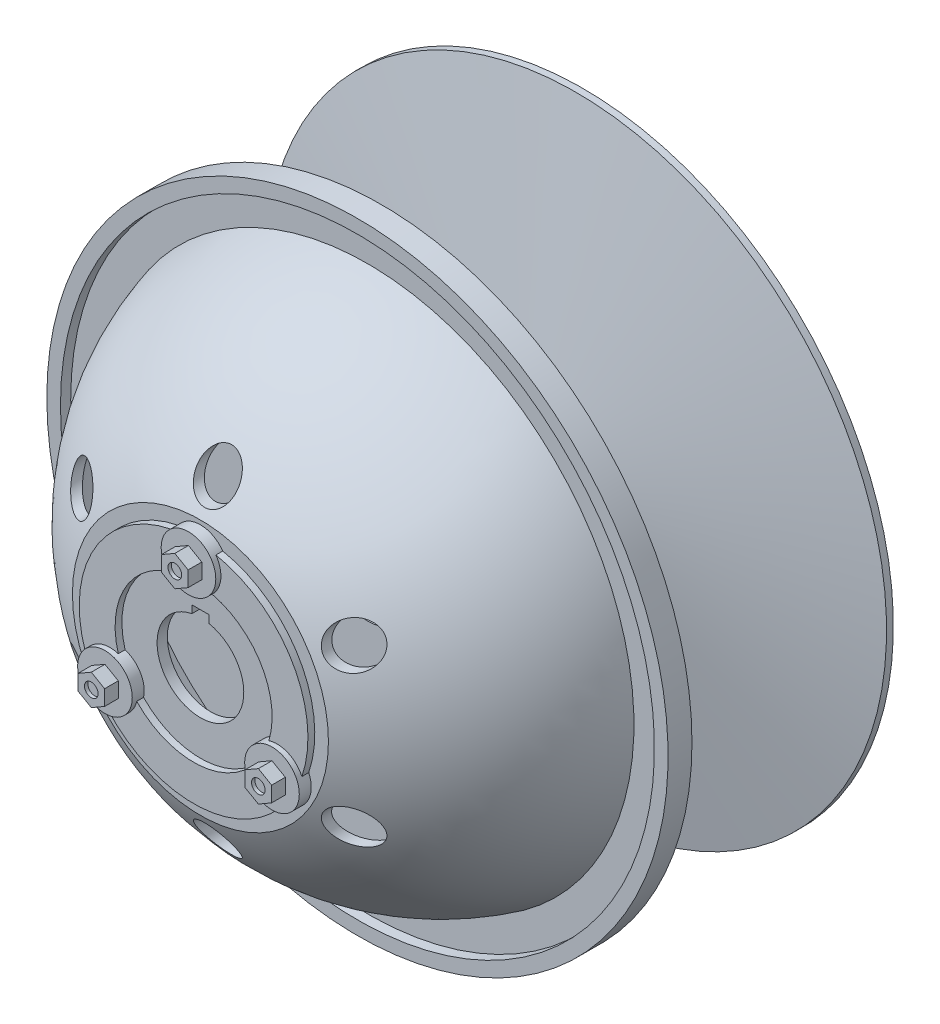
from build123d import *

# Parameters (mm, degrees)
CROQUIS2_R            = 33.5
CROQUIS2_R_2          = 23
EXTRUIR1_DEPTH        = 2
CROQUIS3_R            = 8
EXTRUIR2_DEPTH        = 3.5
EXTRUIR3_DEPTH        = 4
CROQUIS5_R            = 2
CORTAR_EXTRUIR1_DEPTH = 1
CROQUIS6_R            = 6
CORTAR_EXTRUIR2_DEPTH = 45
CORTAR_EXTRUIR3_DEPTH = 171.604806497


with BuildPart() as part:
    # Croquis1 → Revoluci_n1 (revolve)
    with BuildSketch(Plane(origin=(0, 0, 0), x_dir=(0, 0, -1), z_dir=(1, 0, 0)), mode=Mode.PRIVATE) as revoluci_n1_sk:
        with BuildLine():
            Line((0, 0), (0, 91))
            Line((0, 91), (-2, 91))
            Line((-2, 91), (-15, 17.5))
            Line((-15, 17.5), (-44, 17.5))
            Line((-44, 17.5), (-59, 91))
            Line((-59, 91), (-66, 91))
            Line((-66, 91), (-66, 87))
            Line((-66, 87), (-63, 87))
            Line((-63, 87), (-63, 78))
            ThreePointArc((-63, 78), (-91.919380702, 63.096905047), (-112, 37.5))
            Line((-112, 37.5), (-112, 0))
            Line((-112, 0), (0, 0))
        make_face()
    revolve(revoluci_n1_sk.sketch.rotate(Axis((0, 0, 0), (0, 0, 1)), 90), axis=Axis((0, 0, 0), (0, 0, 1)))

    # Croquis2 → Extruir1 (add)
    with BuildSketch(Plane.XY.offset(112)):
        Circle(CROQUIS2_R)
        Circle(CROQUIS2_R_2, mode=Mode.SUBTRACT)
    extrude(amount=EXTRUIR1_DEPTH)

    # Croquis3 → Extruir2 (add)
    with BuildSketch(Plane.XY.offset(112)):
        with Locations(Location((24.465217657, -14.125, 0), (0, 0, 192.535048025))):
            Circle(CROQUIS3_R)
        with Locations(Location((0, 28.25, 0), (0, 0, 144.85581182))):
            Circle(CROQUIS3_R)
        with Locations(Location((-24.465217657, -14.125, 0), (0, 0, 155.14418818))):
            Circle(CROQUIS3_R)
    extrude(amount=EXTRUIR2_DEPTH)

    # Croquis4 → Extruir3 (add)
    with BuildSketch(Plane.XY.offset(115.5)):
        Polygon((20.570432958, -16.373654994), (20.570432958, -11.876345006), (24.465217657, -9.627690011), (28.360002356, -11.876345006), (28.360002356, -16.373654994), (24.465217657, -18.622309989), align=None)
        Polygon((-3.894784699, 30.498654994), (0, 32.747309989), (3.894784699, 30.498654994), (3.894784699, 26.001345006), (0, 23.752690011), (-3.894784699, 26.001345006), align=None)
        Polygon((-24.465217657, -9.627690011), (-20.570432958, -11.876345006), (-20.570432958, -16.373654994), (-24.465217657, -18.622309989), (-28.360002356, -16.373654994), (-28.360002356, -11.876345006), align=None)
    extrude(amount=EXTRUIR3_DEPTH)

    # Croquis5 → Cortar-Extruir1 (cut)
    with BuildSketch(Plane.XY.offset(119.5)):
        with Locations((0, 28.25)):
            Circle(CROQUIS5_R)
        with Locations((24.465217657, -14.125)):
            Circle(CROQUIS5_R)
        with Locations((-24.465217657, -14.125)):
            Circle(CROQUIS5_R)
    extrude(amount=-CORTAR_EXTRUIR1_DEPTH, mode=Mode.SUBTRACT)

    # Croquis6 → Cortar-Extruir2 (cut)
    with BuildSketch(Plane.XY.offset(112)):
        with Locations((0, 46)):
            Circle(CROQUIS6_R)
        with Locations((39.837168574, 23)):
            Circle(CROQUIS6_R)
        with Locations((39.837168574, -23)):
            Circle(CROQUIS6_R)
        with Locations((0, -46)):
            Circle(CROQUIS6_R)
        with Locations((-39.837168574, -23)):
            Circle(CROQUIS6_R)
        with Locations((-39.837168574, 23)):
            Circle(CROQUIS6_R)
    extrude(amount=-CORTAR_EXTRUIR2_DEPTH, mode=Mode.SUBTRACT)

    # Croquis7 → Cortar-Extruir3 (cut, through all)
    with BuildSketch(Plane.XY.offset(112)):
        with BuildLine():
            Line((-2.5, 14.7), (2.5, 14.7))
            Line((2.5, 14.7), (2.5, 12.451505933))
            ThreePointArc((2.5, 12.451505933), (0, -12.7), (-2.5, 12.451505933))
            Line((-2.5, 12.451505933), (-2.5, 14.7))
        make_face()
    extrude(amount=-CORTAR_EXTRUIR3_DEPTH, mode=Mode.SUBTRACT)

    # Croquis9 → Cortar-Revoluci_n1 (revolve, cut)
    with BuildSketch(Plane(origin=(0, 0, 0), x_dir=(0, 0, -1), z_dir=(1, 0, 0)), mode=Mode.PRIVATE) as cortar_revoluci_n1_sk:
        with BuildLine():
            Line((-109, 6.473111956), (-63, 6.473111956))
            Line((-63, 6.473111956), (-63, 75))
            ThreePointArc((-63, 75), (-89.848330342, 60.970618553), (-109, 37.5))
            Line((-109, 37.5), (-109, 6.473111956))
        make_face()
    revolve(cortar_revoluci_n1_sk.sketch.rotate(Axis((0, -0.124247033, 112), (0, 0, -1)), 90), axis=Axis((0, -0.124247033, 112), (0, 0, -1)), mode=Mode.SUBTRACT)


solid = part.part
